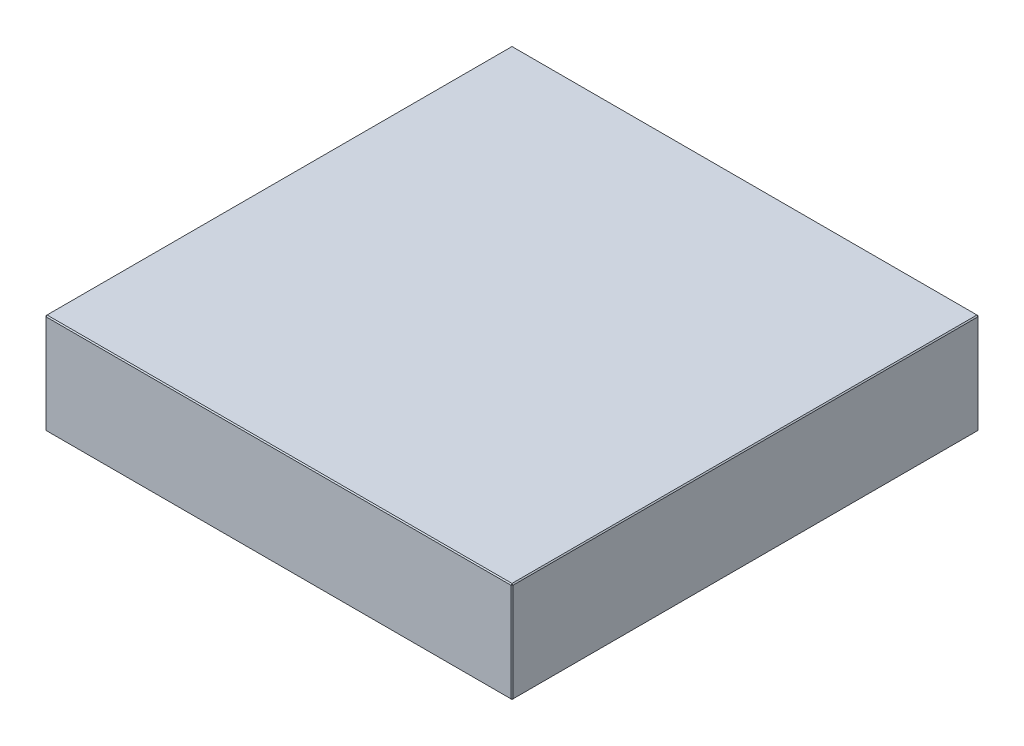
ISO-10303-21;
HEADER;
FILE_DESCRIPTION(('STEP AP214'),'2;1');
FILE_NAME('part.step','',(''),(''),'','','');
FILE_SCHEMA(('AUTOMOTIVE_DESIGN { 1 0 10303 214 1 1 1 1 }'));
ENDSEC;
DATA;
#1=APPLICATION_CONTEXT('core data for automotive mechanical design processes');
#2=APPLICATION_PROTOCOL_DEFINITION('international standard','automotive_design',2000,#1);
#3=PRODUCT_CONTEXT('',#1,'mechanical');
#4=PRODUCT('Part','Part','',(#3));
#5=PRODUCT_RELATED_PRODUCT_CATEGORY('part','',(#4));
#6=PRODUCT_DEFINITION_FORMATION('','',#4);
#7=PRODUCT_DEFINITION_CONTEXT('part definition',#1,'design');
#8=PRODUCT_DEFINITION('design','',#6,#7);
#9=PRODUCT_DEFINITION_SHAPE('','',#8);
#10=(LENGTH_UNIT() NAMED_UNIT(*) SI_UNIT(.MILLI.,.METRE.));
#11=(NAMED_UNIT(*) PLANE_ANGLE_UNIT() SI_UNIT($,.RADIAN.));
#12=(NAMED_UNIT(*) SI_UNIT($,.STERADIAN.) SOLID_ANGLE_UNIT());
#13=UNCERTAINTY_MEASURE_WITH_UNIT(LENGTH_MEASURE(1.E-05),#10,'distance_accuracy_value','');
#14=(GEOMETRIC_REPRESENTATION_CONTEXT(3) GLOBAL_UNCERTAINTY_ASSIGNED_CONTEXT((#13)) GLOBAL_UNIT_ASSIGNED_CONTEXT((#10,
#11,#12)) REPRESENTATION_CONTEXT('',''));
#15=CARTESIAN_POINT('',(0.,0.,0.));
#16=DIRECTION('',(0.,0.,1.));
#17=DIRECTION('',(1.,0.,0.));
#18=AXIS2_PLACEMENT_3D('',#15,#16,#17);
#19=CARTESIAN_POINT('',(-223.,96.,223.));
#20=DIRECTION('',(1.,0.,0.));
#21=DIRECTION('',(0.,0.,-1.));
#22=AXIS2_PLACEMENT_3D('',#19,#20,#21);
#23=PLANE('',#22);
#24=DIRECTION('',(0.,-1.,0.));
#25=VECTOR('',#24,1.);
#26=CARTESIAN_POINT('',(-223.,96.,-222.));
#27=LINE('',#26,#25);
#28=CARTESIAN_POINT('',(-223.,95.,-222.));
#29=VERTEX_POINT('',#28);
#30=CARTESIAN_POINT('',(-223.,1.,-222.));
#31=VERTEX_POINT('',#30);
#32=EDGE_CURVE('E114',#29,#31,#27,.T.);
#33=ORIENTED_EDGE('',*,*,#32,.T.);
#34=DIRECTION('',(0.,0.,1.));
#35=VECTOR('',#34,1.);
#36=CARTESIAN_POINT('',(-223.,1.,223.));
#37=LINE('',#36,#35);
#38=CARTESIAN_POINT('',(-223.,1.,222.));
#39=VERTEX_POINT('',#38);
#40=EDGE_CURVE('E110',#31,#39,#37,.T.);
#41=ORIENTED_EDGE('',*,*,#40,.T.);
#42=DIRECTION('',(0.,1.,0.));
#43=VECTOR('',#42,1.);
#44=CARTESIAN_POINT('',(-223.,96.,222.));
#45=LINE('',#44,#43);
#46=CARTESIAN_POINT('',(-223.,95.,222.));
#47=VERTEX_POINT('',#46);
#48=EDGE_CURVE('E103',#39,#47,#45,.T.);
#49=ORIENTED_EDGE('',*,*,#48,.T.);
#50=DIRECTION('',(0.,0.,-1.));
#51=VECTOR('',#50,1.);
#52=CARTESIAN_POINT('',(-223.,95.,-223.));
#53=LINE('',#52,#51);
#54=EDGE_CURVE('E107',#47,#29,#53,.T.);
#55=ORIENTED_EDGE('',*,*,#54,.T.);
#56=EDGE_LOOP('',(#33,#41,#49,#55));
#57=FACE_BOUND('',#56,.T.);
#58=ADVANCED_FACE('F15',(#57),#23,.F.);
#59=CARTESIAN_POINT('',(223.,96.,223.));
#60=DIRECTION('',(0.,0.,-1.));
#61=DIRECTION('',(-1.,0.,0.));
#62=AXIS2_PLACEMENT_3D('',#59,#60,#61);
#63=PLANE('',#62);
#64=DIRECTION('',(-1.,0.,0.));
#65=VECTOR('',#64,1.);
#66=CARTESIAN_POINT('',(-223.,95.,223.));
#67=LINE('',#66,#65);
#68=CARTESIAN_POINT('',(222.,95.,223.));
#69=VERTEX_POINT('',#68);
#70=CARTESIAN_POINT('',(-222.,95.,223.));
#71=VERTEX_POINT('',#70);
#72=EDGE_CURVE('E164',#69,#71,#67,.T.);
#73=ORIENTED_EDGE('',*,*,#72,.T.);
#74=DIRECTION('',(0.,-1.,0.));
#75=VECTOR('',#74,1.);
#76=CARTESIAN_POINT('',(-222.,96.,223.));
#77=LINE('',#76,#75);
#78=CARTESIAN_POINT('',(-222.,1.00000000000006,223.));
#79=VERTEX_POINT('',#78);
#80=EDGE_CURVE('E122',#71,#79,#77,.T.);
#81=ORIENTED_EDGE('',*,*,#80,.T.);
#82=DIRECTION('',(1.,0.,0.));
#83=VECTOR('',#82,1.);
#84=CARTESIAN_POINT('',(223.,1.00000000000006,223.));
#85=LINE('',#84,#83);
#86=CARTESIAN_POINT('',(222.,1.00000000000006,223.));
#87=VERTEX_POINT('',#86);
#88=EDGE_CURVE('E168',#79,#87,#85,.T.);
#89=ORIENTED_EDGE('',*,*,#88,.T.);
#90=DIRECTION('',(0.,1.,0.));
#91=VECTOR('',#90,1.);
#92=CARTESIAN_POINT('',(222.,96.,223.));
#93=LINE('',#92,#91);
#94=EDGE_CURVE('E166',#87,#69,#93,.T.);
#95=ORIENTED_EDGE('',*,*,#94,.T.);
#96=EDGE_LOOP('',(#73,#81,#89,#95));
#97=FACE_BOUND('',#96,.T.);
#98=ADVANCED_FACE('F275',(#97),#63,.F.);
#99=CARTESIAN_POINT('',(223.,96.,223.));
#100=DIRECTION('',(-1.,0.,0.));
#101=DIRECTION('',(0.,0.,1.));
#102=AXIS2_PLACEMENT_3D('',#99,#100,#101);
#103=PLANE('',#102);
#104=DIRECTION('',(0.,0.,-1.));
#105=VECTOR('',#104,1.);
#106=CARTESIAN_POINT('',(223.,1.00000000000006,223.));
#107=LINE('',#106,#105);
#108=CARTESIAN_POINT('',(223.,1.00000000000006,222.));
#109=VERTEX_POINT('',#108);
#110=CARTESIAN_POINT('',(223.,1.00000000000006,-222.));
#111=VERTEX_POINT('',#110);
#112=EDGE_CURVE('E159',#109,#111,#107,.T.);
#113=ORIENTED_EDGE('',*,*,#112,.T.);
#114=DIRECTION('',(0.,1.,0.));
#115=VECTOR('',#114,1.);
#116=CARTESIAN_POINT('',(223.,96.,-222.));
#117=LINE('',#116,#115);
#118=CARTESIAN_POINT('',(223.,95.,-222.));
#119=VERTEX_POINT('',#118);
#120=EDGE_CURVE('E161',#111,#119,#117,.T.);
#121=ORIENTED_EDGE('',*,*,#120,.T.);
#122=DIRECTION('',(0.,0.,1.));
#123=VECTOR('',#122,1.);
#124=CARTESIAN_POINT('',(223.,95.,223.));
#125=LINE('',#124,#123);
#126=CARTESIAN_POINT('',(223.,95.,222.));
#127=VERTEX_POINT('',#126);
#128=EDGE_CURVE('E155',#119,#127,#125,.T.);
#129=ORIENTED_EDGE('',*,*,#128,.T.);
#130=DIRECTION('',(0.,-1.,0.));
#131=VECTOR('',#130,1.);
#132=CARTESIAN_POINT('',(223.,96.,222.));
#133=LINE('',#132,#131);
#134=EDGE_CURVE('E157',#127,#109,#133,.T.);
#135=ORIENTED_EDGE('',*,*,#134,.T.);
#136=EDGE_LOOP('',(#113,#121,#129,#135));
#137=FACE_BOUND('',#136,.T.);
#138=ADVANCED_FACE('F254',(#137),#103,.F.);
#139=CARTESIAN_POINT('',(223.,96.,-223.));
#140=DIRECTION('',(0.,0.,1.));
#141=DIRECTION('',(1.,0.,0.));
#142=AXIS2_PLACEMENT_3D('',#139,#140,#141);
#143=PLANE('',#142);
#144=DIRECTION('',(0.,-1.,0.));
#145=VECTOR('',#144,1.);
#146=CARTESIAN_POINT('',(222.,96.,-223.));
#147=LINE('',#146,#145);
#148=CARTESIAN_POINT('',(222.,95.,-223.));
#149=VERTEX_POINT('',#148);
#150=CARTESIAN_POINT('',(222.,1.00000000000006,-223.));
#151=VERTEX_POINT('',#150);
#152=EDGE_CURVE('E148',#149,#151,#147,.T.);
#153=ORIENTED_EDGE('',*,*,#152,.T.);
#154=DIRECTION('',(-1.,0.,0.));
#155=VECTOR('',#154,1.);
#156=CARTESIAN_POINT('',(223.,1.00000000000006,-223.));
#157=LINE('',#156,#155);
#158=CARTESIAN_POINT('',(-222.,1.00000000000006,-223.));
#159=VERTEX_POINT('',#158);
#160=EDGE_CURVE('E153',#151,#159,#157,.T.);
#161=ORIENTED_EDGE('',*,*,#160,.T.);
#162=DIRECTION('',(0.,1.,0.));
#163=VECTOR('',#162,1.);
#164=CARTESIAN_POINT('',(-222.,96.,-223.));
#165=LINE('',#164,#163);
#166=CARTESIAN_POINT('',(-222.,95.,-223.));
#167=VERTEX_POINT('',#166);
#168=EDGE_CURVE('E150',#159,#167,#165,.T.);
#169=ORIENTED_EDGE('',*,*,#168,.T.);
#170=DIRECTION('',(1.,0.,0.));
#171=VECTOR('',#170,1.);
#172=CARTESIAN_POINT('',(223.,95.,-223.));
#173=LINE('',#172,#171);
#174=EDGE_CURVE('E146',#167,#149,#173,.T.);
#175=ORIENTED_EDGE('',*,*,#174,.T.);
#176=EDGE_LOOP('',(#153,#161,#169,#175));
#177=FACE_BOUND('',#176,.T.);
#178=ADVANCED_FACE('F284',(#177),#143,.F.);
#179=CARTESIAN_POINT('',(0.,96.,0.));
#180=DIRECTION('',(0.,1.,0.));
#181=DIRECTION('',(0.,0.,1.));
#182=AXIS2_PLACEMENT_3D('',#179,#180,#181);
#183=PLANE('',#182);
#184=DIRECTION('',(0.,0.,-1.));
#185=VECTOR('',#184,1.);
#186=CARTESIAN_POINT('',(222.,96.,-223.));
#187=LINE('',#186,#185);
#188=CARTESIAN_POINT('',(222.,96.,222.));
#189=VERTEX_POINT('',#188);
#190=CARTESIAN_POINT('',(222.,96.,-222.));
#191=VERTEX_POINT('',#190);
#192=EDGE_CURVE('E24',#189,#191,#187,.T.);
#193=ORIENTED_EDGE('',*,*,#192,.T.);
#194=DIRECTION('',(-1.,0.,0.));
#195=VECTOR('',#194,1.);
#196=CARTESIAN_POINT('',(-223.,96.,-222.));
#197=LINE('',#196,#195);
#198=CARTESIAN_POINT('',(-222.,96.,-222.));
#199=VERTEX_POINT('',#198);
#200=EDGE_CURVE('E9',#191,#199,#197,.T.);
#201=ORIENTED_EDGE('',*,*,#200,.T.);
#202=DIRECTION('',(0.,0.,1.));
#203=VECTOR('',#202,1.);
#204=CARTESIAN_POINT('',(-222.,96.,223.));
#205=LINE('',#204,#203);
#206=CARTESIAN_POINT('',(-222.,96.,222.));
#207=VERTEX_POINT('',#206);
#208=EDGE_CURVE('E180',#199,#207,#205,.T.);
#209=ORIENTED_EDGE('',*,*,#208,.T.);
#210=DIRECTION('',(1.,0.,0.));
#211=VECTOR('',#210,1.);
#212=CARTESIAN_POINT('',(223.,96.,222.));
#213=LINE('',#212,#211);
#214=EDGE_CURVE('E35',#207,#189,#213,.T.);
#215=ORIENTED_EDGE('',*,*,#214,.T.);
#216=EDGE_LOOP('',(#193,#201,#209,#215));
#217=FACE_BOUND('',#216,.T.);
#218=ADVANCED_FACE('F350',(#217),#183,.T.);
#219=CARTESIAN_POINT('',(0.,0.,0.));
#220=DIRECTION('',(0.,1.,0.));
#221=DIRECTION('',(0.,0.,1.));
#222=AXIS2_PLACEMENT_3D('',#219,#220,#221);
#223=PLANE('',#222);
#224=DIRECTION('',(0.,0.,1.));
#225=VECTOR('',#224,1.);
#226=CARTESIAN_POINT('',(222.,0.,0.));
#227=LINE('',#226,#225);
#228=CARTESIAN_POINT('',(222.,0.,-222.));
#229=VERTEX_POINT('',#228);
#230=CARTESIAN_POINT('',(222.,0.,222.));
#231=VERTEX_POINT('',#230);
#232=EDGE_CURVE('E171',#229,#231,#227,.T.);
#233=ORIENTED_EDGE('',*,*,#232,.T.);
#234=DIRECTION('',(-1.,0.,0.));
#235=VECTOR('',#234,1.);
#236=CARTESIAN_POINT('',(0.,0.,222.));
#237=LINE('',#236,#235);
#238=CARTESIAN_POINT('',(-222.,0.,222.));
#239=VERTEX_POINT('',#238);
#240=EDGE_CURVE('E177',#231,#239,#237,.T.);
#241=ORIENTED_EDGE('',*,*,#240,.T.);
#242=DIRECTION('',(0.,0.,-1.));
#243=VECTOR('',#242,1.);
#244=CARTESIAN_POINT('',(-222.,0.,0.));
#245=LINE('',#244,#243);
#246=CARTESIAN_POINT('',(-222.,0.,-222.));
#247=VERTEX_POINT('',#246);
#248=EDGE_CURVE('E175',#239,#247,#245,.T.);
#249=ORIENTED_EDGE('',*,*,#248,.T.);
#250=DIRECTION('',(1.,0.,0.));
#251=VECTOR('',#250,1.);
#252=CARTESIAN_POINT('',(0.,0.,-222.));
#253=LINE('',#252,#251);
#254=EDGE_CURVE('E173',#247,#229,#253,.T.);
#255=ORIENTED_EDGE('',*,*,#254,.T.);
#256=EDGE_LOOP('',(#233,#241,#249,#255));
#257=FACE_BOUND('',#256,.T.);
#258=ADVANCED_FACE('F246',(#257),#223,.F.);
#259=CARTESIAN_POINT('',(223.,96.,222.));
#260=DIRECTION('',(-0.707106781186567,0.,-0.707106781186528));
#261=DIRECTION('',(0.,-1.,0.));
#262=AXIS2_PLACEMENT_3D('',#259,#260,#261);
#263=PLANE('',#262);
#264=DIRECTION('',(-0.707106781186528,0.,0.707106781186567));
#265=VECTOR('',#264,1.);
#266=CARTESIAN_POINT('',(222.,95.,223.));
#267=LINE('',#266,#265);
#268=EDGE_CURVE('E19',#69,#127,#267,.F.);
#269=ORIENTED_EDGE('',*,*,#268,.F.);
#270=ORIENTED_EDGE('',*,*,#94,.F.);
#271=DIRECTION('',(0.707106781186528,0.,-0.707106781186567));
#272=VECTOR('',#271,1.);
#273=CARTESIAN_POINT('',(222.,1.00000000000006,223.));
#274=LINE('',#273,#272);
#275=EDGE_CURVE('E142',#109,#87,#274,.F.);
#276=ORIENTED_EDGE('',*,*,#275,.F.);
#277=ORIENTED_EDGE('',*,*,#134,.F.);
#278=EDGE_LOOP('',(#269,#270,#276,#277));
#279=FACE_BOUND('',#278,.T.);
#280=ADVANCED_FACE('F17',(#279),#263,.F.);
#281=CARTESIAN_POINT('',(222.,95.,223.));
#282=DIRECTION('',(0.577350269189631,0.577350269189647,0.577350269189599));
#283=DIRECTION('',(-0.707106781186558,0.707106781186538,0.));
#284=AXIS2_PLACEMENT_3D('',#281,#282,#283);
#285=PLANE('',#284);
#286=DIRECTION('',(0.,-0.707106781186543,0.707106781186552));
#287=VECTOR('',#286,1.);
#288=CARTESIAN_POINT('',(222.,95.,223.));
#289=LINE('',#288,#287);
#290=EDGE_CURVE('E226',#69,#189,#289,.F.);
#291=ORIENTED_EDGE('',*,*,#290,.F.);
#292=ORIENTED_EDGE('',*,*,#268,.T.);
#293=DIRECTION('',(-0.707106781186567,0.707106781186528,0.));
#294=VECTOR('',#293,1.);
#295=CARTESIAN_POINT('',(222.5,95.5,222.));
#296=LINE('',#295,#294);
#297=EDGE_CURVE('E228',#189,#127,#296,.F.);
#298=ORIENTED_EDGE('',*,*,#297,.F.);
#299=EDGE_LOOP('',(#291,#292,#298));
#300=FACE_BOUND('',#299,.T.);
#301=ADVANCED_FACE('F270',(#300),#285,.T.);
#302=CARTESIAN_POINT('',(222.,1.00000000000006,223.));
#303=DIRECTION('',(0.577350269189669,-0.577350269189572,0.577350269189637));
#304=DIRECTION('',(0.707106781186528,0.,-0.707106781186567));
#305=AXIS2_PLACEMENT_3D('',#302,#303,#304);
#306=PLANE('',#305);
#307=DIRECTION('',(-0.707106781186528,-0.707106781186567,0.));
#308=VECTOR('',#307,1.);
#309=CARTESIAN_POINT('',(222.5,0.5,222.));
#310=LINE('',#309,#308);
#311=EDGE_CURVE('E220',#109,#231,#310,.T.);
#312=ORIENTED_EDGE('',*,*,#311,.F.);
#313=ORIENTED_EDGE('',*,*,#275,.T.);
#314=DIRECTION('',(0.,0.707106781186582,0.707106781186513));
#315=VECTOR('',#314,1.);
#316=CARTESIAN_POINT('',(222.,1.00000000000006,223.));
#317=LINE('',#316,#315);
#318=EDGE_CURVE('E223',#231,#87,#317,.T.);
#319=ORIENTED_EDGE('',*,*,#318,.F.);
#320=EDGE_LOOP('',(#312,#313,#319));
#321=FACE_BOUND('',#320,.T.);
#322=ADVANCED_FACE('F235',(#321),#306,.T.);
#323=CARTESIAN_POINT('',(222.,96.,0.));
#324=DIRECTION('',(0.707106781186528,0.707106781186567,0.));
#325=DIRECTION('',(0.,0.,1.));
#326=AXIS2_PLACEMENT_3D('',#323,#324,#325);
#327=PLANE('',#326);
#328=ORIENTED_EDGE('',*,*,#297,.T.);
#329=ORIENTED_EDGE('',*,*,#128,.F.);
#330=DIRECTION('',(0.707106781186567,-0.707106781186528,0.));
#331=VECTOR('',#330,1.);
#332=CARTESIAN_POINT('',(223.,95.,-222.));
#333=LINE('',#332,#331);
#334=EDGE_CURVE('E215',#191,#119,#333,.T.);
#335=ORIENTED_EDGE('',*,*,#334,.F.);
#336=ORIENTED_EDGE('',*,*,#192,.F.);
#337=EDGE_LOOP('',(#328,#329,#335,#336));
#338=FACE_BOUND('',#337,.T.);
#339=ADVANCED_FACE('F265',(#338),#327,.T.);
#340=CARTESIAN_POINT('',(0.,96.,222.));
#341=DIRECTION('',(0.,0.707106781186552,0.707106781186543));
#342=DIRECTION('',(-1.,0.,0.));
#343=AXIS2_PLACEMENT_3D('',#340,#341,#342);
#344=PLANE('',#343);
#345=ORIENTED_EDGE('',*,*,#290,.T.);
#346=ORIENTED_EDGE('',*,*,#214,.F.);
#347=DIRECTION('',(0.,0.707106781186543,-0.707106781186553));
#348=VECTOR('',#347,1.);
#349=CARTESIAN_POINT('',(-222.,95.5,222.5));
#350=LINE('',#349,#348);
#351=EDGE_CURVE('E126',#71,#207,#350,.T.);
#352=ORIENTED_EDGE('',*,*,#351,.F.);
#353=ORIENTED_EDGE('',*,*,#72,.F.);
#354=EDGE_LOOP('',(#345,#346,#352,#353));
#355=FACE_BOUND('',#354,.T.);
#356=ADVANCED_FACE('F273',(#355),#344,.T.);
#357=CARTESIAN_POINT('',(-222.,96.,223.));
#358=DIRECTION('',(0.707106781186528,0.,-0.707106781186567));
#359=DIRECTION('',(0.,-1.,0.));
#360=AXIS2_PLACEMENT_3D('',#357,#358,#359);
#361=PLANE('',#360);
#362=DIRECTION('',(0.707106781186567,0.,0.707106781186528));
#363=VECTOR('',#362,1.);
#364=CARTESIAN_POINT('',(-222.,1.00000000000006,223.));
#365=LINE('',#364,#363);
#366=EDGE_CURVE('E127',#79,#39,#365,.F.);
#367=ORIENTED_EDGE('',*,*,#366,.F.);
#368=ORIENTED_EDGE('',*,*,#80,.F.);
#369=DIRECTION('',(-0.707106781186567,0.,-0.707106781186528));
#370=VECTOR('',#369,1.);
#371=CARTESIAN_POINT('',(-223.,95.,222.));
#372=LINE('',#371,#370);
#373=EDGE_CURVE('E118',#47,#71,#372,.F.);
#374=ORIENTED_EDGE('',*,*,#373,.F.);
#375=ORIENTED_EDGE('',*,*,#48,.F.);
#376=EDGE_LOOP('',(#367,#368,#374,#375));
#377=FACE_BOUND('',#376,.T.);
#378=ADVANCED_FACE('F120',(#377),#361,.F.);
#379=CARTESIAN_POINT('',(223.,1.00000000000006,223.));
#380=DIRECTION('',(0.,0.707106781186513,-0.707106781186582));
#381=DIRECTION('',(1.,0.,0.));
#382=AXIS2_PLACEMENT_3D('',#379,#380,#381);
#383=PLANE('',#382);
#384=ORIENTED_EDGE('',*,*,#318,.T.);
#385=ORIENTED_EDGE('',*,*,#88,.F.);
#386=DIRECTION('',(0.,-0.707106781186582,-0.707106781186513));
#387=VECTOR('',#386,1.);
#388=CARTESIAN_POINT('',(-222.,1.00000000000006,223.));
#389=LINE('',#388,#387);
#390=EDGE_CURVE('E211',#239,#79,#389,.F.);
#391=ORIENTED_EDGE('',*,*,#390,.F.);
#392=ORIENTED_EDGE('',*,*,#240,.F.);
#393=EDGE_LOOP('',(#384,#385,#391,#392));
#394=FACE_BOUND('',#393,.T.);
#395=ADVANCED_FACE('F243',(#394),#383,.F.);
#396=CARTESIAN_POINT('',(223.,1.00000000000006,223.));
#397=DIRECTION('',(-0.707106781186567,0.707106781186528,0.));
#398=DIRECTION('',(0.,0.,-1.));
#399=AXIS2_PLACEMENT_3D('',#396,#397,#398);
#400=PLANE('',#399);
#401=ORIENTED_EDGE('',*,*,#311,.T.);
#402=ORIENTED_EDGE('',*,*,#232,.F.);
#403=DIRECTION('',(0.707106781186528,0.707106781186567,0.));
#404=VECTOR('',#403,1.);
#405=CARTESIAN_POINT('',(222.5,0.500000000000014,-222.));
#406=LINE('',#405,#404);
#407=EDGE_CURVE('E208',#111,#229,#406,.F.);
#408=ORIENTED_EDGE('',*,*,#407,.F.);
#409=ORIENTED_EDGE('',*,*,#112,.F.);
#410=EDGE_LOOP('',(#401,#402,#408,#409));
#411=FACE_BOUND('',#410,.T.);
#412=ADVANCED_FACE('F251',(#411),#400,.F.);
#413=CARTESIAN_POINT('',(222.,96.,-223.));
#414=DIRECTION('',(-0.707106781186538,0.,0.707106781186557));
#415=DIRECTION('',(0.,-1.,0.));
#416=AXIS2_PLACEMENT_3D('',#413,#414,#415);
#417=PLANE('',#416);
#418=DIRECTION('',(0.707106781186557,0.,0.707106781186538));
#419=VECTOR('',#418,1.);
#420=CARTESIAN_POINT('',(223.,95.,-222.));
#421=LINE('',#420,#419);
#422=EDGE_CURVE('E217',#119,#149,#421,.F.);
#423=ORIENTED_EDGE('',*,*,#422,.F.);
#424=ORIENTED_EDGE('',*,*,#120,.F.);
#425=DIRECTION('',(-0.707106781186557,0.,-0.707106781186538));
#426=VECTOR('',#425,1.);
#427=CARTESIAN_POINT('',(222.,1.00000000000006,-223.));
#428=LINE('',#427,#426);
#429=EDGE_CURVE('E205',#151,#111,#428,.F.);
#430=ORIENTED_EDGE('',*,*,#429,.F.);
#431=ORIENTED_EDGE('',*,*,#152,.F.);
#432=EDGE_LOOP('',(#423,#424,#430,#431));
#433=FACE_BOUND('',#432,.T.);
#434=ADVANCED_FACE('F258',(#433),#417,.F.);
#435=CARTESIAN_POINT('',(223.,95.,-222.));
#436=DIRECTION('',(0.577350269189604,0.577350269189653,-0.57735026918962));
#437=DIRECTION('',(0.,0.707106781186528,0.707106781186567));
#438=AXIS2_PLACEMENT_3D('',#435,#436,#437);
#439=PLANE('',#438);
#440=ORIENTED_EDGE('',*,*,#334,.T.);
#441=ORIENTED_EDGE('',*,*,#422,.T.);
#442=DIRECTION('',(0.,0.707106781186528,0.707106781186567));
#443=VECTOR('',#442,1.);
#444=CARTESIAN_POINT('',(222.,95.5,-222.5));
#445=LINE('',#444,#443);
#446=EDGE_CURVE('E134',#191,#149,#445,.F.);
#447=ORIENTED_EDGE('',*,*,#446,.F.);
#448=EDGE_LOOP('',(#440,#441,#447));
#449=FACE_BOUND('',#448,.T.);
#450=ADVANCED_FACE('F325',(#449),#439,.T.);
#451=CARTESIAN_POINT('',(-223.,95.,222.));
#452=DIRECTION('',(-0.577350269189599,0.577350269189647,0.577350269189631));
#453=DIRECTION('',(0.,-0.707106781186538,0.707106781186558));
#454=AXIS2_PLACEMENT_3D('',#451,#452,#453);
#455=PLANE('',#454);
#456=ORIENTED_EDGE('',*,*,#373,.T.);
#457=ORIENTED_EDGE('',*,*,#351,.T.);
#458=DIRECTION('',(-0.707106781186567,-0.707106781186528,0.));
#459=VECTOR('',#458,1.);
#460=CARTESIAN_POINT('',(-223.,95.,222.));
#461=LINE('',#460,#459);
#462=EDGE_CURVE('E130',#47,#207,#461,.F.);
#463=ORIENTED_EDGE('',*,*,#462,.F.);
#464=EDGE_LOOP('',(#456,#457,#463));
#465=FACE_BOUND('',#464,.T.);
#466=ADVANCED_FACE('F131',(#465),#455,.T.);
#467=CARTESIAN_POINT('',(-222.,1.00000000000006,223.));
#468=DIRECTION('',(-0.577350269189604,-0.577350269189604,0.577350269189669));
#469=DIRECTION('',(0.707106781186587,0.,0.707106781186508));
#470=AXIS2_PLACEMENT_3D('',#467,#468,#469);
#471=PLANE('',#470);
#472=ORIENTED_EDGE('',*,*,#390,.T.);
#473=ORIENTED_EDGE('',*,*,#366,.T.);
#474=DIRECTION('',(-0.707106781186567,0.707106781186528,0.));
#475=VECTOR('',#474,1.);
#476=CARTESIAN_POINT('',(-222.5,0.499999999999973,222.));
#477=LINE('',#476,#475);
#478=EDGE_CURVE('E135',#239,#39,#477,.T.);
#479=ORIENTED_EDGE('',*,*,#478,.F.);
#480=EDGE_LOOP('',(#472,#473,#479));
#481=FACE_BOUND('',#480,.T.);
#482=ADVANCED_FACE('F318',(#481),#471,.T.);
#483=CARTESIAN_POINT('',(222.,1.00000000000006,-223.));
#484=DIRECTION('',(0.577350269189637,-0.577350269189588,-0.577350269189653));
#485=DIRECTION('',(-0.707106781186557,0.,-0.707106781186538));
#486=AXIS2_PLACEMENT_3D('',#483,#484,#485);
#487=PLANE('',#486);
#488=ORIENTED_EDGE('',*,*,#429,.T.);
#489=ORIENTED_EDGE('',*,*,#407,.T.);
#490=DIRECTION('',(0.,-0.707106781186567,0.707106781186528));
#491=VECTOR('',#490,1.);
#492=CARTESIAN_POINT('',(222.,1.00000000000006,-223.));
#493=LINE('',#492,#491);
#494=EDGE_CURVE('E198',#151,#229,#493,.T.);
#495=ORIENTED_EDGE('',*,*,#494,.F.);
#496=EDGE_LOOP('',(#488,#489,#495));
#497=FACE_BOUND('',#496,.T.);
#498=ADVANCED_FACE('F314',(#497),#487,.T.);
#499=CARTESIAN_POINT('',(0.,96.,-222.));
#500=DIRECTION('',(0.,0.707106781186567,-0.707106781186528));
#501=DIRECTION('',(1.,0.,0.));
#502=AXIS2_PLACEMENT_3D('',#499,#500,#501);
#503=PLANE('',#502);
#504=ORIENTED_EDGE('',*,*,#446,.T.);
#505=ORIENTED_EDGE('',*,*,#174,.F.);
#506=DIRECTION('',(0.,-0.707106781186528,-0.707106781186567));
#507=VECTOR('',#506,1.);
#508=CARTESIAN_POINT('',(-222.,95.,-223.));
#509=LINE('',#508,#507);
#510=EDGE_CURVE('E195',#199,#167,#509,.T.);
#511=ORIENTED_EDGE('',*,*,#510,.F.);
#512=ORIENTED_EDGE('',*,*,#200,.F.);
#513=EDGE_LOOP('',(#504,#505,#511,#512));
#514=FACE_BOUND('',#513,.T.);
#515=ADVANCED_FACE('F311',(#514),#503,.T.);
#516=CARTESIAN_POINT('',(-222.,96.,0.));
#517=DIRECTION('',(-0.707106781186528,0.707106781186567,0.));
#518=DIRECTION('',(0.,0.,-1.));
#519=AXIS2_PLACEMENT_3D('',#516,#517,#518);
#520=PLANE('',#519);
#521=ORIENTED_EDGE('',*,*,#462,.T.);
#522=ORIENTED_EDGE('',*,*,#208,.F.);
#523=DIRECTION('',(0.707106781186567,0.707106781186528,0.));
#524=VECTOR('',#523,1.);
#525=CARTESIAN_POINT('',(-222.5,95.5,-222.));
#526=LINE('',#525,#524);
#527=EDGE_CURVE('E138',#29,#199,#526,.T.);
#528=ORIENTED_EDGE('',*,*,#527,.F.);
#529=ORIENTED_EDGE('',*,*,#54,.F.);
#530=EDGE_LOOP('',(#521,#522,#528,#529));
#531=FACE_BOUND('',#530,.T.);
#532=ADVANCED_FACE('F137',(#531),#520,.T.);
#533=CARTESIAN_POINT('',(-223.,1.,223.));
#534=DIRECTION('',(0.707106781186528,0.707106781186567,0.));
#535=DIRECTION('',(0.,0.,1.));
#536=AXIS2_PLACEMENT_3D('',#533,#534,#535);
#537=PLANE('',#536);
#538=ORIENTED_EDGE('',*,*,#478,.T.);
#539=ORIENTED_EDGE('',*,*,#40,.F.);
#540=DIRECTION('',(0.707106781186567,-0.707106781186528,0.));
#541=VECTOR('',#540,1.);
#542=CARTESIAN_POINT('',(-223.,1.,-222.));
#543=LINE('',#542,#541);
#544=EDGE_CURVE('E191',#247,#31,#543,.F.);
#545=ORIENTED_EDGE('',*,*,#544,.F.);
#546=ORIENTED_EDGE('',*,*,#248,.F.);
#547=EDGE_LOOP('',(#538,#539,#545,#546));
#548=FACE_BOUND('',#547,.T.);
#549=ADVANCED_FACE('F304',(#548),#537,.F.);
#550=CARTESIAN_POINT('',(223.,1.00000000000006,-223.));
#551=DIRECTION('',(0.,0.707106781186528,0.707106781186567));
#552=DIRECTION('',(-1.,0.,0.));
#553=AXIS2_PLACEMENT_3D('',#550,#551,#552);
#554=PLANE('',#553);
#555=ORIENTED_EDGE('',*,*,#494,.T.);
#556=ORIENTED_EDGE('',*,*,#254,.F.);
#557=DIRECTION('',(0.,0.707106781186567,-0.707106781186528));
#558=VECTOR('',#557,1.);
#559=CARTESIAN_POINT('',(-222.,0.500000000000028,-222.5));
#560=LINE('',#559,#558);
#561=EDGE_CURVE('E188',#159,#247,#560,.F.);
#562=ORIENTED_EDGE('',*,*,#561,.F.);
#563=ORIENTED_EDGE('',*,*,#160,.F.);
#564=EDGE_LOOP('',(#555,#556,#562,#563));
#565=FACE_BOUND('',#564,.T.);
#566=ADVANCED_FACE('F300',(#565),#554,.F.);
#567=CARTESIAN_POINT('',(-222.,95.,-223.));
#568=DIRECTION('',(-0.577350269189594,0.577350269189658,-0.577350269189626));
#569=DIRECTION('',(0.,0.707106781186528,0.707106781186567));
#570=AXIS2_PLACEMENT_3D('',#567,#568,#569);
#571=PLANE('',#570);
#572=ORIENTED_EDGE('',*,*,#527,.T.);
#573=ORIENTED_EDGE('',*,*,#510,.T.);
#574=DIRECTION('',(0.707106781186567,0.,-0.707106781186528));
#575=VECTOR('',#574,1.);
#576=CARTESIAN_POINT('',(-222.,95.,-223.));
#577=LINE('',#576,#575);
#578=EDGE_CURVE('E186',#29,#167,#577,.T.);
#579=ORIENTED_EDGE('',*,*,#578,.F.);
#580=EDGE_LOOP('',(#572,#573,#579));
#581=FACE_BOUND('',#580,.T.);
#582=ADVANCED_FACE('F296',(#581),#571,.T.);
#583=CARTESIAN_POINT('',(-223.,1.,-222.));
#584=DIRECTION('',(-0.577350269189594,-0.577350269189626,-0.577350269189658));
#585=DIRECTION('',(0.,0.707106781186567,-0.707106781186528));
#586=AXIS2_PLACEMENT_3D('',#583,#584,#585);
#587=PLANE('',#586);
#588=ORIENTED_EDGE('',*,*,#561,.T.);
#589=ORIENTED_EDGE('',*,*,#544,.T.);
#590=DIRECTION('',(-0.707106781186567,0.,0.707106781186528));
#591=VECTOR('',#590,1.);
#592=CARTESIAN_POINT('',(-223.,1.,-222.));
#593=LINE('',#592,#591);
#594=EDGE_CURVE('E184',#159,#31,#593,.T.);
#595=ORIENTED_EDGE('',*,*,#594,.F.);
#596=EDGE_LOOP('',(#588,#589,#595));
#597=FACE_BOUND('',#596,.T.);
#598=ADVANCED_FACE('F292',(#597),#587,.T.);
#599=CARTESIAN_POINT('',(-223.,96.,-222.));
#600=DIRECTION('',(0.707106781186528,0.,0.707106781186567));
#601=DIRECTION('',(0.,-1.,0.));
#602=AXIS2_PLACEMENT_3D('',#599,#600,#601);
#603=PLANE('',#602);
#604=ORIENTED_EDGE('',*,*,#578,.T.);
#605=ORIENTED_EDGE('',*,*,#168,.F.);
#606=ORIENTED_EDGE('',*,*,#594,.T.);
#607=ORIENTED_EDGE('',*,*,#32,.F.);
#608=EDGE_LOOP('',(#604,#605,#606,#607));
#609=FACE_BOUND('',#608,.T.);
#610=ADVANCED_FACE('F289',(#609),#603,.F.);
#611=CLOSED_SHELL('',(#58,#98,#138,#178,#218,#258,#280,#301,#322,#339,#356,#378,#395,#412,#434,
#450,#466,#482,#498,#515,#532,#549,#566,#582,#598,#610));
#612=MANIFOLD_SOLID_BREP('B1',#611);
#613=ADVANCED_BREP_SHAPE_REPRESENTATION('',(#18,#612),#14);
#614=SHAPE_DEFINITION_REPRESENTATION(#9,#613);
ENDSEC;
END-ISO-10303-21;
